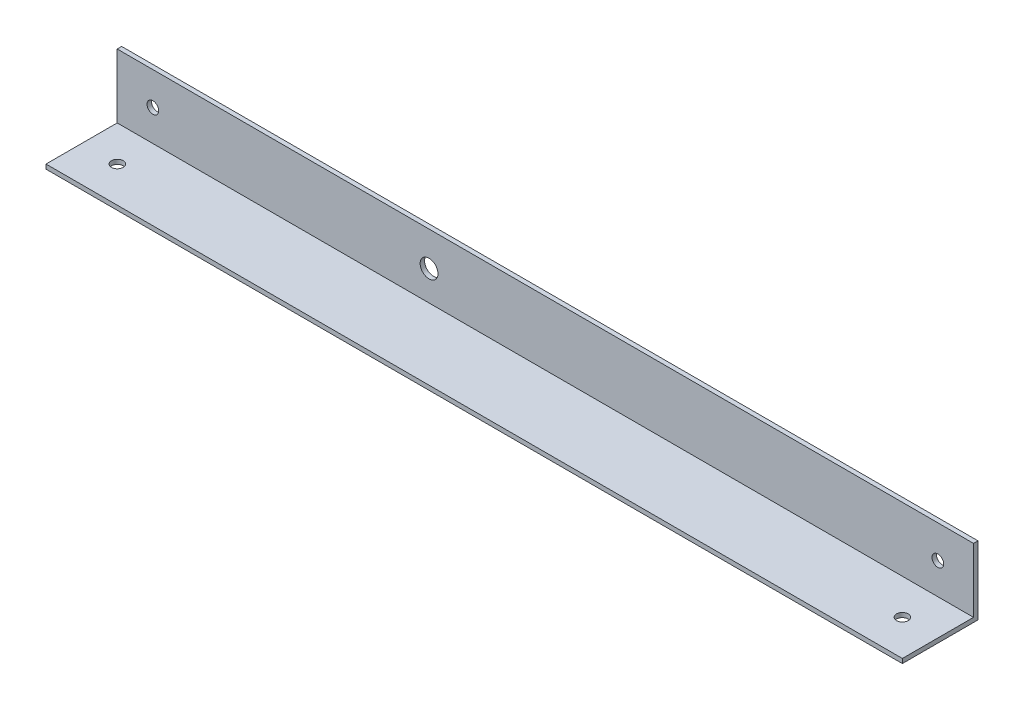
ISO-10303-21;
HEADER;
FILE_DESCRIPTION(('STEP AP214'),'2;1');
FILE_NAME('part.step','',(''),(''),'','','');
FILE_SCHEMA(('AUTOMOTIVE_DESIGN { 1 0 10303 214 1 1 1 1 }'));
ENDSEC;
DATA;
#1=APPLICATION_CONTEXT('core data for automotive mechanical design processes');
#2=APPLICATION_PROTOCOL_DEFINITION('international standard','automotive_design',2000,#1);
#3=PRODUCT_CONTEXT('',#1,'mechanical');
#4=PRODUCT('Part','Part','',(#3));
#5=PRODUCT_RELATED_PRODUCT_CATEGORY('part','',(#4));
#6=PRODUCT_DEFINITION_FORMATION('','',#4);
#7=PRODUCT_DEFINITION_CONTEXT('part definition',#1,'design');
#8=PRODUCT_DEFINITION('design','',#6,#7);
#9=PRODUCT_DEFINITION_SHAPE('','',#8);
#10=(LENGTH_UNIT() NAMED_UNIT(*) SI_UNIT(.MILLI.,.METRE.));
#11=(NAMED_UNIT(*) PLANE_ANGLE_UNIT() SI_UNIT($,.RADIAN.));
#12=(NAMED_UNIT(*) SI_UNIT($,.STERADIAN.) SOLID_ANGLE_UNIT());
#13=UNCERTAINTY_MEASURE_WITH_UNIT(LENGTH_MEASURE(1.E-05),#10,'distance_accuracy_value','');
#14=(GEOMETRIC_REPRESENTATION_CONTEXT(3) GLOBAL_UNCERTAINTY_ASSIGNED_CONTEXT((#13)) GLOBAL_UNIT_ASSIGNED_CONTEXT((#10,
#11,#12)) REPRESENTATION_CONTEXT('',''));
#15=CARTESIAN_POINT('',(0.,0.,0.));
#16=DIRECTION('',(0.,0.,1.));
#17=DIRECTION('',(1.,0.,0.));
#18=AXIS2_PLACEMENT_3D('',#15,#16,#17);
#19=CARTESIAN_POINT('',(0.,0.,26.924));
#20=DIRECTION('',(0.,0.,1.));
#21=DIRECTION('',(1.,0.,0.));
#22=AXIS2_PLACEMENT_3D('',#19,#20,#21);
#23=PLANE('',#22);
#24=DIRECTION('',(1.,0.,0.));
#25=VECTOR('',#24,1.);
#26=CARTESIAN_POINT('',(-209.826086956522,45.0420093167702,26.924));
#27=LINE('',#26,#25);
#28=CARTESIAN_POINT('',(-209.826086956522,45.0420093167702,26.924));
#29=VERTEX_POINT('',#28);
#30=CARTESIAN_POINT('',(94.9739130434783,45.0420093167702,26.924));
#31=VERTEX_POINT('',#30);
#32=EDGE_CURVE('E119',#29,#31,#27,.T.);
#33=ORIENTED_EDGE('',*,*,#32,.F.);
#34=DIRECTION('',(0.,-1.,0.));
#35=VECTOR('',#34,1.);
#36=CARTESIAN_POINT('',(-209.826086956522,67.8385093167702,26.924));
#37=LINE('',#36,#35);
#38=CARTESIAN_POINT('',(-209.826086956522,43.4545093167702,26.924));
#39=VERTEX_POINT('',#38);
#40=EDGE_CURVE('E96',#29,#39,#37,.T.);
#41=ORIENTED_EDGE('',*,*,#40,.T.);
#42=DIRECTION('',(1.,0.,0.));
#43=VECTOR('',#42,1.);
#44=CARTESIAN_POINT('',(-209.826086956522,43.4545093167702,26.924));
#45=LINE('',#44,#43);
#46=CARTESIAN_POINT('',(94.9739130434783,43.4545093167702,26.924));
#47=VERTEX_POINT('',#46);
#48=EDGE_CURVE('E58',#39,#47,#45,.T.);
#49=ORIENTED_EDGE('',*,*,#48,.T.);
#50=DIRECTION('',(0.,1.,0.));
#51=VECTOR('',#50,1.);
#52=CARTESIAN_POINT('',(94.9739130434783,67.8385093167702,26.924));
#53=LINE('',#52,#51);
#54=EDGE_CURVE('E89',#47,#31,#53,.T.);
#55=ORIENTED_EDGE('',*,*,#54,.T.);
#56=EDGE_LOOP('',(#33,#41,#49,#55));
#57=FACE_BOUND('',#56,.T.);
#58=ADVANCED_FACE('F39',(#57),#23,.T.);
#59=CARTESIAN_POINT('',(-209.826086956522,67.8385093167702,26.924));
#60=DIRECTION('',(1.,0.,0.));
#61=DIRECTION('',(0.,0.,-1.));
#62=AXIS2_PLACEMENT_3D('',#59,#60,#61);
#63=PLANE('',#62);
#64=DIRECTION('',(0.,0.,1.));
#65=VECTOR('',#64,1.);
#66=CARTESIAN_POINT('',(-209.826086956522,45.0420093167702,-303.37967743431));
#67=LINE('',#66,#65);
#68=CARTESIAN_POINT('',(-209.826086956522,45.0420093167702,1.58750000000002));
#69=VERTEX_POINT('',#68);
#70=EDGE_CURVE('E144',#69,#29,#67,.T.);
#71=ORIENTED_EDGE('',*,*,#70,.F.);
#72=DIRECTION('',(0.,1.,0.));
#73=VECTOR('',#72,1.);
#74=CARTESIAN_POINT('',(-209.826086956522,55.1385093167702,1.5875));
#75=LINE('',#74,#73);
#76=CARTESIAN_POINT('',(-209.826086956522,67.8385093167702,1.5875));
#77=VERTEX_POINT('',#76);
#78=EDGE_CURVE('E88',#69,#77,#75,.T.);
#79=ORIENTED_EDGE('',*,*,#78,.T.);
#80=DIRECTION('',(0.,0.,-1.));
#81=VECTOR('',#80,1.);
#82=CARTESIAN_POINT('',(-209.826086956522,67.8385093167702,26.924));
#83=LINE('',#82,#81);
#84=CARTESIAN_POINT('',(-209.826086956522,67.8385093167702,0.));
#85=VERTEX_POINT('',#84);
#86=EDGE_CURVE('E82',#77,#85,#83,.T.);
#87=ORIENTED_EDGE('',*,*,#86,.T.);
#88=DIRECTION('',(0.,-1.,0.));
#89=VECTOR('',#88,1.);
#90=CARTESIAN_POINT('',(-209.826086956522,67.8385093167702,0.));
#91=LINE('',#90,#89);
#92=CARTESIAN_POINT('',(-209.826086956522,43.4545093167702,0.));
#93=VERTEX_POINT('',#92);
#94=EDGE_CURVE('E86',#85,#93,#91,.T.);
#95=ORIENTED_EDGE('',*,*,#94,.T.);
#96=DIRECTION('',(0.,0.,-1.));
#97=VECTOR('',#96,1.);
#98=CARTESIAN_POINT('',(-209.826086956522,43.4545093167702,26.924));
#99=LINE('',#98,#97);
#100=EDGE_CURVE('E11',#39,#93,#99,.T.);
#101=ORIENTED_EDGE('',*,*,#100,.F.);
#102=ORIENTED_EDGE('',*,*,#40,.F.);
#103=EDGE_LOOP('',(#71,#79,#87,#95,#101,#102));
#104=FACE_BOUND('',#103,.T.);
#105=ADVANCED_FACE('F41',(#104),#63,.F.);
#106=CARTESIAN_POINT('',(-209.826086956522,43.4545093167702,26.924));
#107=DIRECTION('',(0.,1.,0.));
#108=DIRECTION('',(0.,0.,1.));
#109=AXIS2_PLACEMENT_3D('',#106,#107,#108);
#110=PLANE('',#109);
#111=CARTESIAN_POINT('',(-197.126086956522,43.4545093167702,14.224));
#112=DIRECTION('',(0.,-1.,0.));
#113=DIRECTION('',(0.,0.,-1.));
#114=AXIS2_PLACEMENT_3D('',#111,#112,#113);
#115=CIRCLE('',#114,2.08279999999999);
#116=CARTESIAN_POINT('',(-197.126086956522,43.4545093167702,12.1412));
#117=VERTEX_POINT('',#116);
#118=EDGE_CURVE('E123',#117,#117,#115,.T.);
#119=ORIENTED_EDGE('',*,*,#118,.F.);
#120=EDGE_LOOP('',(#119));
#121=FACE_BOUND('',#120,.T.);
#122=CARTESIAN_POINT('',(82.2739130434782,43.4545093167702,14.224));
#123=DIRECTION('',(0.,-1.,0.));
#124=DIRECTION('',(0.,0.,1.));
#125=AXIS2_PLACEMENT_3D('',#122,#123,#124);
#126=CIRCLE('',#125,2.0828);
#127=CARTESIAN_POINT('',(82.2739130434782,43.4545093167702,16.3068));
#128=VERTEX_POINT('',#127);
#129=EDGE_CURVE('E327',#128,#128,#126,.T.);
#130=ORIENTED_EDGE('',*,*,#129,.F.);
#131=EDGE_LOOP('',(#130));
#132=FACE_BOUND('',#131,.T.);
#133=DIRECTION('',(1.,0.,0.));
#134=VECTOR('',#133,1.);
#135=CARTESIAN_POINT('',(-209.826086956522,43.4545093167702,0.));
#136=LINE('',#135,#134);
#137=CARTESIAN_POINT('',(94.9739130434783,43.4545093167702,0.));
#138=VERTEX_POINT('',#137);
#139=EDGE_CURVE('E100',#93,#138,#136,.T.);
#140=ORIENTED_EDGE('',*,*,#139,.T.);
#141=DIRECTION('',(0.,0.,-1.));
#142=VECTOR('',#141,1.);
#143=CARTESIAN_POINT('',(94.9739130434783,43.4545093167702,26.924));
#144=LINE('',#143,#142);
#145=EDGE_CURVE('E49',#47,#138,#144,.T.);
#146=ORIENTED_EDGE('',*,*,#145,.F.);
#147=ORIENTED_EDGE('',*,*,#48,.F.);
#148=ORIENTED_EDGE('',*,*,#100,.T.);
#149=EDGE_LOOP('',(#140,#146,#147,#148));
#150=FACE_BOUND('',#149,.T.);
#151=ADVANCED_FACE('F175',(#121,#132,#150),#110,.F.);
#152=CARTESIAN_POINT('',(94.9739130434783,67.8385093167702,26.924));
#153=DIRECTION('',(-1.,0.,0.));
#154=DIRECTION('',(0.,0.,1.));
#155=AXIS2_PLACEMENT_3D('',#152,#153,#154);
#156=PLANE('',#155);
#157=DIRECTION('',(0.,1.,0.));
#158=VECTOR('',#157,1.);
#159=CARTESIAN_POINT('',(94.9739130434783,55.1385093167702,1.5875));
#160=LINE('',#159,#158);
#161=CARTESIAN_POINT('',(94.9739130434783,45.0420093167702,1.58750000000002));
#162=VERTEX_POINT('',#161);
#163=CARTESIAN_POINT('',(94.9739130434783,67.8385093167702,1.5875));
#164=VERTEX_POINT('',#163);
#165=EDGE_CURVE('E103',#162,#164,#160,.T.);
#166=ORIENTED_EDGE('',*,*,#165,.F.);
#167=DIRECTION('',(0.,0.,1.));
#168=VECTOR('',#167,1.);
#169=CARTESIAN_POINT('',(94.9739130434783,45.0420093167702,-303.37967743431));
#170=LINE('',#169,#168);
#171=EDGE_CURVE('E141',#162,#31,#170,.T.);
#172=ORIENTED_EDGE('',*,*,#171,.T.);
#173=ORIENTED_EDGE('',*,*,#54,.F.);
#174=ORIENTED_EDGE('',*,*,#145,.T.);
#175=DIRECTION('',(0.,1.,0.));
#176=VECTOR('',#175,1.);
#177=CARTESIAN_POINT('',(94.9739130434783,67.8385093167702,0.));
#178=LINE('',#177,#176);
#179=CARTESIAN_POINT('',(94.9739130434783,67.8385093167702,0.));
#180=VERTEX_POINT('',#179);
#181=EDGE_CURVE('E97',#138,#180,#178,.T.);
#182=ORIENTED_EDGE('',*,*,#181,.T.);
#183=DIRECTION('',(0.,0.,-1.));
#184=VECTOR('',#183,1.);
#185=CARTESIAN_POINT('',(94.9739130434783,67.8385093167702,26.924));
#186=LINE('',#185,#184);
#187=EDGE_CURVE('E75',#164,#180,#186,.T.);
#188=ORIENTED_EDGE('',*,*,#187,.F.);
#189=EDGE_LOOP('',(#166,#172,#173,#174,#182,#188));
#190=FACE_BOUND('',#189,.T.);
#191=ADVANCED_FACE('F161',(#190),#156,.F.);
#192=CARTESIAN_POINT('',(-209.826086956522,67.8385093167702,26.924));
#193=DIRECTION('',(0.,-1.,0.));
#194=DIRECTION('',(0.,0.,-1.));
#195=AXIS2_PLACEMENT_3D('',#192,#193,#194);
#196=PLANE('',#195);
#197=ORIENTED_EDGE('',*,*,#86,.F.);
#198=DIRECTION('',(-1.,0.,0.));
#199=VECTOR('',#198,1.);
#200=CARTESIAN_POINT('',(-209.826086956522,67.8385093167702,1.5875));
#201=LINE('',#200,#199);
#202=EDGE_CURVE('E147',#164,#77,#201,.T.);
#203=ORIENTED_EDGE('',*,*,#202,.F.);
#204=ORIENTED_EDGE('',*,*,#187,.T.);
#205=DIRECTION('',(-1.,0.,0.));
#206=VECTOR('',#205,1.);
#207=CARTESIAN_POINT('',(-209.826086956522,67.8385093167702,0.));
#208=LINE('',#207,#206);
#209=EDGE_CURVE('E92',#180,#85,#208,.T.);
#210=ORIENTED_EDGE('',*,*,#209,.T.);
#211=EDGE_LOOP('',(#197,#203,#204,#210));
#212=FACE_BOUND('',#211,.T.);
#213=ADVANCED_FACE('F93',(#212),#196,.F.);
#214=CARTESIAN_POINT('',(0.,0.,0.));
#215=DIRECTION('',(0.,0.,1.));
#216=DIRECTION('',(1.,0.,0.));
#217=AXIS2_PLACEMENT_3D('',#214,#215,#216);
#218=PLANE('',#217);
#219=CARTESIAN_POINT('',(-98.8280869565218,55.6465093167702,0.));
#220=DIRECTION('',(0.,0.,-1.));
#221=DIRECTION('',(-1.,0.,0.));
#222=AXIS2_PLACEMENT_3D('',#219,#220,#221);
#223=CIRCLE('',#222,3.18);
#224=CARTESIAN_POINT('',(-102.008086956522,55.6465093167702,0.));
#225=VERTEX_POINT('',#224);
#226=EDGE_CURVE('E324',#225,#225,#223,.T.);
#227=ORIENTED_EDGE('',*,*,#226,.F.);
#228=EDGE_LOOP('',(#227));
#229=FACE_BOUND('',#228,.T.);
#230=CARTESIAN_POINT('',(82.2739130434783,56.1545093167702,0.));
#231=DIRECTION('',(0.,0.,-1.));
#232=DIRECTION('',(-1.,0.,0.));
#233=AXIS2_PLACEMENT_3D('',#230,#231,#232);
#234=CIRCLE('',#233,2.0828);
#235=CARTESIAN_POINT('',(80.1911130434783,56.1545093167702,0.));
#236=VERTEX_POINT('',#235);
#237=EDGE_CURVE('E116',#236,#236,#234,.T.);
#238=ORIENTED_EDGE('',*,*,#237,.F.);
#239=EDGE_LOOP('',(#238));
#240=FACE_BOUND('',#239,.T.);
#241=CARTESIAN_POINT('',(-197.126086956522,56.1545093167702,0.));
#242=DIRECTION('',(0.,0.,-1.));
#243=DIRECTION('',(1.,0.,0.));
#244=AXIS2_PLACEMENT_3D('',#241,#242,#243);
#245=CIRCLE('',#244,2.08279999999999);
#246=CARTESIAN_POINT('',(-195.043286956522,56.1545093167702,0.));
#247=VERTEX_POINT('',#246);
#248=EDGE_CURVE('E125',#247,#247,#245,.T.);
#249=ORIENTED_EDGE('',*,*,#248,.F.);
#250=EDGE_LOOP('',(#249));
#251=FACE_BOUND('',#250,.T.);
#252=ORIENTED_EDGE('',*,*,#94,.F.);
#253=ORIENTED_EDGE('',*,*,#209,.F.);
#254=ORIENTED_EDGE('',*,*,#181,.F.);
#255=ORIENTED_EDGE('',*,*,#139,.F.);
#256=EDGE_LOOP('',(#252,#253,#254,#255));
#257=FACE_BOUND('',#256,.T.);
#258=ADVANCED_FACE('F99',(#229,#240,#251,#257),#218,.F.);
#259=CARTESIAN_POINT('',(-209.826086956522,55.1385093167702,1.5875));
#260=DIRECTION('',(0.,0.,-1.));
#261=DIRECTION('',(-1.,0.,0.));
#262=AXIS2_PLACEMENT_3D('',#259,#260,#261);
#263=PLANE('',#262);
#264=CARTESIAN_POINT('',(-98.8280869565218,55.6465093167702,1.5875));
#265=DIRECTION('',(0.,0.,-1.));
#266=DIRECTION('',(-1.,0.,0.));
#267=AXIS2_PLACEMENT_3D('',#264,#265,#266);
#268=CIRCLE('',#267,3.18);
#269=CARTESIAN_POINT('',(-102.008086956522,55.6465093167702,1.5875));
#270=VERTEX_POINT('',#269);
#271=EDGE_CURVE('E43',#270,#270,#268,.T.);
#272=ORIENTED_EDGE('',*,*,#271,.T.);
#273=EDGE_LOOP('',(#272));
#274=FACE_BOUND('',#273,.T.);
#275=CARTESIAN_POINT('',(82.2739130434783,56.1545093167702,1.5875));
#276=DIRECTION('',(0.,0.,-1.));
#277=DIRECTION('',(-1.,0.,0.));
#278=AXIS2_PLACEMENT_3D('',#275,#276,#277);
#279=CIRCLE('',#278,2.0828);
#280=CARTESIAN_POINT('',(80.1911130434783,56.1545093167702,1.5875));
#281=VERTEX_POINT('',#280);
#282=EDGE_CURVE('E115',#281,#281,#279,.T.);
#283=ORIENTED_EDGE('',*,*,#282,.T.);
#284=EDGE_LOOP('',(#283));
#285=FACE_BOUND('',#284,.T.);
#286=CARTESIAN_POINT('',(-197.126086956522,56.1545093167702,1.5875));
#287=DIRECTION('',(0.,0.,-1.));
#288=DIRECTION('',(-1.,0.,0.));
#289=AXIS2_PLACEMENT_3D('',#286,#287,#288);
#290=CIRCLE('',#289,2.08279999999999);
#291=CARTESIAN_POINT('',(-199.208886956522,56.1545093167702,1.5875));
#292=VERTEX_POINT('',#291);
#293=EDGE_CURVE('E112',#292,#292,#290,.T.);
#294=ORIENTED_EDGE('',*,*,#293,.T.);
#295=EDGE_LOOP('',(#294));
#296=FACE_BOUND('',#295,.T.);
#297=ORIENTED_EDGE('',*,*,#202,.T.);
#298=ORIENTED_EDGE('',*,*,#78,.F.);
#299=DIRECTION('',(1.,0.,0.));
#300=VECTOR('',#299,1.);
#301=CARTESIAN_POINT('',(-209.826086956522,45.0420093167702,1.58750000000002));
#302=LINE('',#301,#300);
#303=EDGE_CURVE('E138',#69,#162,#302,.T.);
#304=ORIENTED_EDGE('',*,*,#303,.T.);
#305=ORIENTED_EDGE('',*,*,#165,.T.);
#306=EDGE_LOOP('',(#297,#298,#304,#305));
#307=FACE_BOUND('',#306,.T.);
#308=ADVANCED_FACE('F169',(#274,#285,#296,#307),#263,.F.);
#309=CARTESIAN_POINT('',(-209.826086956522,45.0420093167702,-303.37967743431));
#310=DIRECTION('',(0.,-1.,0.));
#311=DIRECTION('',(0.,0.,-1.));
#312=AXIS2_PLACEMENT_3D('',#309,#310,#311);
#313=PLANE('',#312);
#314=CARTESIAN_POINT('',(-197.126086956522,45.0420093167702,14.224));
#315=DIRECTION('',(0.,-1.,0.));
#316=DIRECTION('',(0.,0.,-1.));
#317=AXIS2_PLACEMENT_3D('',#314,#315,#316);
#318=CIRCLE('',#317,2.08279999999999);
#319=CARTESIAN_POINT('',(-197.126086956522,45.0420093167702,12.1412));
#320=VERTEX_POINT('',#319);
#321=EDGE_CURVE('E122',#320,#320,#318,.T.);
#322=ORIENTED_EDGE('',*,*,#321,.T.);
#323=EDGE_LOOP('',(#322));
#324=FACE_BOUND('',#323,.T.);
#325=CARTESIAN_POINT('',(82.2739130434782,45.0420093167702,14.224));
#326=DIRECTION('',(0.,-1.,0.));
#327=DIRECTION('',(0.,0.,-1.));
#328=AXIS2_PLACEMENT_3D('',#325,#326,#327);
#329=CIRCLE('',#328,2.0828);
#330=CARTESIAN_POINT('',(82.2739130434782,45.0420093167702,12.1412));
#331=VERTEX_POINT('',#330);
#332=EDGE_CURVE('E120',#331,#331,#329,.T.);
#333=ORIENTED_EDGE('',*,*,#332,.T.);
#334=EDGE_LOOP('',(#333));
#335=FACE_BOUND('',#334,.T.);
#336=ORIENTED_EDGE('',*,*,#70,.T.);
#337=ORIENTED_EDGE('',*,*,#32,.T.);
#338=ORIENTED_EDGE('',*,*,#171,.F.);
#339=ORIENTED_EDGE('',*,*,#303,.F.);
#340=EDGE_LOOP('',(#336,#337,#338,#339));
#341=FACE_BOUND('',#340,.T.);
#342=ADVANCED_FACE('F166',(#324,#335,#341),#313,.F.);
#343=CARTESIAN_POINT('',(-197.126086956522,56.1545093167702,2.54));
#344=DIRECTION('',(0.,0.,-1.));
#345=DIRECTION('',(-1.,0.,0.));
#346=AXIS2_PLACEMENT_3D('',#343,#344,#345);
#347=CYLINDRICAL_SURFACE('',#346,2.08279999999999);
#348=ORIENTED_EDGE('',*,*,#248,.T.);
#349=EDGE_LOOP('',(#348));
#350=FACE_BOUND('',#349,.T.);
#351=ORIENTED_EDGE('',*,*,#293,.F.);
#352=EDGE_LOOP('',(#351));
#353=FACE_BOUND('',#352,.T.);
#354=ADVANCED_FACE('F218',(#350,#353),#347,.F.);
#355=CARTESIAN_POINT('',(82.2739130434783,56.1545093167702,2.54));
#356=DIRECTION('',(0.,0.,-1.));
#357=DIRECTION('',(-1.,0.,0.));
#358=AXIS2_PLACEMENT_3D('',#355,#356,#357);
#359=CYLINDRICAL_SURFACE('',#358,2.0828);
#360=ORIENTED_EDGE('',*,*,#237,.T.);
#361=EDGE_LOOP('',(#360));
#362=FACE_BOUND('',#361,.T.);
#363=ORIENTED_EDGE('',*,*,#282,.F.);
#364=EDGE_LOOP('',(#363));
#365=FACE_BOUND('',#364,.T.);
#366=ADVANCED_FACE('F225',(#362,#365),#359,.F.);
#367=CARTESIAN_POINT('',(82.2739130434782,45.9945093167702,14.224));
#368=DIRECTION('',(0.,-1.,0.));
#369=DIRECTION('',(0.,0.,-1.));
#370=AXIS2_PLACEMENT_3D('',#367,#368,#369);
#371=CYLINDRICAL_SURFACE('',#370,2.0828);
#372=ORIENTED_EDGE('',*,*,#129,.T.);
#373=EDGE_LOOP('',(#372));
#374=FACE_BOUND('',#373,.T.);
#375=ORIENTED_EDGE('',*,*,#332,.F.);
#376=EDGE_LOOP('',(#375));
#377=FACE_BOUND('',#376,.T.);
#378=ADVANCED_FACE('F232',(#374,#377),#371,.F.);
#379=CARTESIAN_POINT('',(-197.126086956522,45.9945093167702,14.224));
#380=DIRECTION('',(0.,-1.,0.));
#381=DIRECTION('',(0.,0.,-1.));
#382=AXIS2_PLACEMENT_3D('',#379,#380,#381);
#383=CYLINDRICAL_SURFACE('',#382,2.08279999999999);
#384=ORIENTED_EDGE('',*,*,#118,.T.);
#385=EDGE_LOOP('',(#384));
#386=FACE_BOUND('',#385,.T.);
#387=ORIENTED_EDGE('',*,*,#321,.F.);
#388=EDGE_LOOP('',(#387));
#389=FACE_BOUND('',#388,.T.);
#390=ADVANCED_FACE('F239',(#386,#389),#383,.F.);
#391=CARTESIAN_POINT('',(-98.8280869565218,55.6465093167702,2.54));
#392=DIRECTION('',(0.,0.,-1.));
#393=DIRECTION('',(-1.,0.,0.));
#394=AXIS2_PLACEMENT_3D('',#391,#392,#393);
#395=CYLINDRICAL_SURFACE('',#394,3.18);
#396=ORIENTED_EDGE('',*,*,#226,.T.);
#397=EDGE_LOOP('',(#396));
#398=FACE_BOUND('',#397,.T.);
#399=ORIENTED_EDGE('',*,*,#271,.F.);
#400=EDGE_LOOP('',(#399));
#401=FACE_BOUND('',#400,.T.);
#402=ADVANCED_FACE('F246',(#398,#401),#395,.F.);
#403=CLOSED_SHELL('',(#58,#105,#151,#191,#213,#258,#308,#342,#354,#366,#378,#390,#402));
#404=MANIFOLD_SOLID_BREP('B2',#403);
#405=ADVANCED_BREP_SHAPE_REPRESENTATION('',(#18,#404),#14);
#406=SHAPE_DEFINITION_REPRESENTATION(#9,#405);
ENDSEC;
END-ISO-10303-21;
